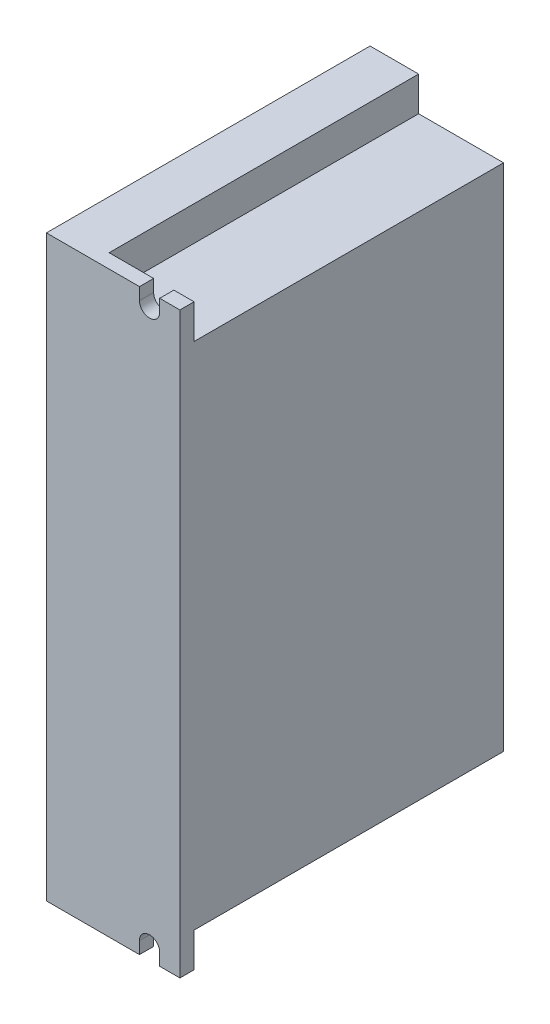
ISO-10303-21;
HEADER;
FILE_DESCRIPTION(('STEP AP214'),'2;1');
FILE_NAME('part.step','',(''),(''),'','','');
FILE_SCHEMA(('AUTOMOTIVE_DESIGN { 1 0 10303 214 1 1 1 1 }'));
ENDSEC;
DATA;
#1=APPLICATION_CONTEXT('core data for automotive mechanical design processes');
#2=APPLICATION_PROTOCOL_DEFINITION('international standard','automotive_design',2000,#1);
#3=PRODUCT_CONTEXT('',#1,'mechanical');
#4=PRODUCT('Part','Part','',(#3));
#5=PRODUCT_RELATED_PRODUCT_CATEGORY('part','',(#4));
#6=PRODUCT_DEFINITION_FORMATION('','',#4);
#7=PRODUCT_DEFINITION_CONTEXT('part definition',#1,'design');
#8=PRODUCT_DEFINITION('design','',#6,#7);
#9=PRODUCT_DEFINITION_SHAPE('','',#8);
#10=(LENGTH_UNIT() NAMED_UNIT(*) SI_UNIT(.MILLI.,.METRE.));
#11=(NAMED_UNIT(*) PLANE_ANGLE_UNIT() SI_UNIT($,.RADIAN.));
#12=(NAMED_UNIT(*) SI_UNIT($,.STERADIAN.) SOLID_ANGLE_UNIT());
#13=UNCERTAINTY_MEASURE_WITH_UNIT(LENGTH_MEASURE(1.E-05),#10,'distance_accuracy_value','');
#14=(GEOMETRIC_REPRESENTATION_CONTEXT(3) GLOBAL_UNCERTAINTY_ASSIGNED_CONTEXT((#13)) GLOBAL_UNIT_ASSIGNED_CONTEXT((#10,
#11,#12)) REPRESENTATION_CONTEXT('',''));
#15=CARTESIAN_POINT('',(0.,0.,0.));
#16=DIRECTION('',(0.,0.,1.));
#17=DIRECTION('',(1.,0.,0.));
#18=AXIS2_PLACEMENT_3D('',#15,#16,#17);
#19=CARTESIAN_POINT('',(33.,71.5,40.));
#20=DIRECTION('',(0.,-1.,0.));
#21=DIRECTION('',(0.,0.,-1.));
#22=AXIS2_PLACEMENT_3D('',#19,#20,#21);
#23=PLANE('',#22);
#24=DIRECTION('',(1.,0.,0.));
#25=VECTOR('',#24,1.);
#26=CARTESIAN_POINT('',(12.,71.5,36.5));
#27=LINE('',#26,#25);
#28=CARTESIAN_POINT('',(28.,71.5,36.5));
#29=VERTEX_POINT('',#28);
#30=CARTESIAN_POINT('',(33.,71.5,36.5));
#31=VERTEX_POINT('',#30);
#32=EDGE_CURVE('E228',#29,#31,#27,.T.);
#33=ORIENTED_EDGE('',*,*,#32,.F.);
#34=DIRECTION('',(0.,0.,-1.));
#35=VECTOR('',#34,1.);
#36=CARTESIAN_POINT('',(28.,71.5,40.));
#37=LINE('',#36,#35);
#38=CARTESIAN_POINT('',(28.,71.5,40.));
#39=VERTEX_POINT('',#38);
#40=EDGE_CURVE('E185',#39,#29,#37,.T.);
#41=ORIENTED_EDGE('',*,*,#40,.F.);
#42=DIRECTION('',(-1.,0.,0.));
#43=VECTOR('',#42,1.);
#44=CARTESIAN_POINT('',(33.,71.5,40.));
#45=LINE('',#44,#43);
#46=CARTESIAN_POINT('',(33.,71.5,40.));
#47=VERTEX_POINT('',#46);
#48=EDGE_CURVE('E41',#47,#39,#45,.T.);
#49=ORIENTED_EDGE('',*,*,#48,.F.);
#50=DIRECTION('',(0.,0.,1.));
#51=VECTOR('',#50,1.);
#52=CARTESIAN_POINT('',(33.,71.5,40.));
#53=LINE('',#52,#51);
#54=EDGE_CURVE('E269',#31,#47,#53,.T.);
#55=ORIENTED_EDGE('',*,*,#54,.F.);
#56=EDGE_LOOP('',(#33,#41,#49,#55));
#57=FACE_BOUND('',#56,.T.);
#58=ADVANCED_FACE('F33',(#57),#23,.F.);
#59=CARTESIAN_POINT('',(33.,-71.5,40.));
#60=DIRECTION('',(0.,1.,0.));
#61=DIRECTION('',(0.,0.,1.));
#62=AXIS2_PLACEMENT_3D('',#59,#60,#61);
#63=PLANE('',#62);
#64=DIRECTION('',(1.,0.,0.));
#65=VECTOR('',#64,1.);
#66=CARTESIAN_POINT('',(12.,-71.5,36.5));
#67=LINE('',#66,#65);
#68=CARTESIAN_POINT('',(12.,-71.5,36.5));
#69=VERTEX_POINT('',#68);
#70=CARTESIAN_POINT('',(23.,-71.5,36.5));
#71=VERTEX_POINT('',#70);
#72=EDGE_CURVE('E258',#69,#71,#67,.T.);
#73=ORIENTED_EDGE('',*,*,#72,.T.);
#74=DIRECTION('',(0.,0.,-1.));
#75=VECTOR('',#74,1.);
#76=CARTESIAN_POINT('',(23.,-71.5,40.));
#77=LINE('',#76,#75);
#78=CARTESIAN_POINT('',(23.,-71.5,40.));
#79=VERTEX_POINT('',#78);
#80=EDGE_CURVE('E210',#79,#71,#77,.T.);
#81=ORIENTED_EDGE('',*,*,#80,.F.);
#82=DIRECTION('',(-1.,0.,0.));
#83=VECTOR('',#82,1.);
#84=CARTESIAN_POINT('',(33.,-71.5,40.));
#85=LINE('',#84,#83);
#86=CARTESIAN_POINT('',(0.,-71.5,40.));
#87=VERTEX_POINT('',#86);
#88=EDGE_CURVE('E289',#79,#87,#85,.T.);
#89=ORIENTED_EDGE('',*,*,#88,.T.);
#90=DIRECTION('',(0.,0.,-1.));
#91=VECTOR('',#90,1.);
#92=CARTESIAN_POINT('',(0.,-71.5,40.));
#93=LINE('',#92,#91);
#94=CARTESIAN_POINT('',(0.,-71.5,-40.));
#95=VERTEX_POINT('',#94);
#96=EDGE_CURVE('E270',#87,#95,#93,.T.);
#97=ORIENTED_EDGE('',*,*,#96,.T.);
#98=DIRECTION('',(-1.,0.,0.));
#99=VECTOR('',#98,1.);
#100=CARTESIAN_POINT('',(33.,-71.5,-40.));
#101=LINE('',#100,#99);
#102=CARTESIAN_POINT('',(12.,-71.5,-40.));
#103=VERTEX_POINT('',#102);
#104=EDGE_CURVE('E277',#103,#95,#101,.T.);
#105=ORIENTED_EDGE('',*,*,#104,.F.);
#106=DIRECTION('',(0.,0.,-1.));
#107=VECTOR('',#106,1.);
#108=CARTESIAN_POINT('',(12.,-71.5,-40.));
#109=LINE('',#108,#107);
#110=EDGE_CURVE('E241',#69,#103,#109,.T.);
#111=ORIENTED_EDGE('',*,*,#110,.F.);
#112=EDGE_LOOP('',(#73,#81,#89,#97,#105,#111));
#113=FACE_BOUND('',#112,.T.);
#114=ADVANCED_FACE('F307',(#113),#63,.F.);
#115=CARTESIAN_POINT('',(33.,-71.5,-40.));
#116=DIRECTION('',(0.,0.,1.));
#117=DIRECTION('',(1.,0.,0.));
#118=AXIS2_PLACEMENT_3D('',#115,#116,#117);
#119=PLANE('',#118);
#120=DIRECTION('',(0.,1.,0.));
#121=VECTOR('',#120,1.);
#122=CARTESIAN_POINT('',(12.,71.5,-40.));
#123=LINE('',#122,#121);
#124=CARTESIAN_POINT('',(12.,63.,-40.));
#125=VERTEX_POINT('',#124);
#126=CARTESIAN_POINT('',(12.,71.5,-40.));
#127=VERTEX_POINT('',#126);
#128=EDGE_CURVE('E226',#125,#127,#123,.T.);
#129=ORIENTED_EDGE('',*,*,#128,.F.);
#130=DIRECTION('',(1.,0.,0.));
#131=VECTOR('',#130,1.);
#132=CARTESIAN_POINT('',(12.,63.,-40.));
#133=LINE('',#132,#131);
#134=CARTESIAN_POINT('',(33.,63.,-40.));
#135=VERTEX_POINT('',#134);
#136=EDGE_CURVE('E232',#125,#135,#133,.T.);
#137=ORIENTED_EDGE('',*,*,#136,.T.);
#138=DIRECTION('',(0.,1.,0.));
#139=VECTOR('',#138,1.);
#140=CARTESIAN_POINT('',(33.,-71.5,-40.));
#141=LINE('',#140,#139);
#142=CARTESIAN_POINT('',(33.,-63.,-40.));
#143=VERTEX_POINT('',#142);
#144=EDGE_CURVE('E266',#143,#135,#141,.T.);
#145=ORIENTED_EDGE('',*,*,#144,.F.);
#146=DIRECTION('',(1.,0.,0.));
#147=VECTOR('',#146,1.);
#148=CARTESIAN_POINT('',(12.,-63.,-40.));
#149=LINE('',#148,#147);
#150=CARTESIAN_POINT('',(12.,-63.,-40.));
#151=VERTEX_POINT('',#150);
#152=EDGE_CURVE('E253',#151,#143,#149,.T.);
#153=ORIENTED_EDGE('',*,*,#152,.F.);
#154=DIRECTION('',(0.,1.,0.));
#155=VECTOR('',#154,1.);
#156=CARTESIAN_POINT('',(12.,-63.,-40.));
#157=LINE('',#156,#155);
#158=EDGE_CURVE('E243',#103,#151,#157,.T.);
#159=ORIENTED_EDGE('',*,*,#158,.F.);
#160=ORIENTED_EDGE('',*,*,#104,.T.);
#161=DIRECTION('',(0.,1.,0.));
#162=VECTOR('',#161,1.);
#163=CARTESIAN_POINT('',(0.,-71.5,-40.));
#164=LINE('',#163,#162);
#165=CARTESIAN_POINT('',(0.,71.5,-40.));
#166=VERTEX_POINT('',#165);
#167=EDGE_CURVE('E261',#95,#166,#164,.T.);
#168=ORIENTED_EDGE('',*,*,#167,.T.);
#169=DIRECTION('',(-1.,0.,0.));
#170=VECTOR('',#169,1.);
#171=CARTESIAN_POINT('',(33.,71.5,-40.));
#172=LINE('',#171,#170);
#173=EDGE_CURVE('E11',#127,#166,#172,.T.);
#174=ORIENTED_EDGE('',*,*,#173,.F.);
#175=EDGE_LOOP('',(#129,#137,#145,#153,#159,#160,#168,#174));
#176=FACE_BOUND('',#175,.T.);
#177=ADVANCED_FACE('F35',(#176),#119,.F.);
#178=CARTESIAN_POINT('',(23.,71.5,40.));
#179=VERTEX_POINT('',#178);
#180=CARTESIAN_POINT('',(0.,71.5,40.));
#181=VERTEX_POINT('',#180);
#182=EDGE_CURVE('E292',#179,#181,#45,.T.);
#183=ORIENTED_EDGE('',*,*,#182,.F.);
#184=DIRECTION('',(0.,0.,-1.));
#185=VECTOR('',#184,1.);
#186=CARTESIAN_POINT('',(23.,71.5,40.));
#187=LINE('',#186,#185);
#188=CARTESIAN_POINT('',(23.,71.5,36.5));
#189=VERTEX_POINT('',#188);
#190=EDGE_CURVE('E187',#179,#189,#187,.T.);
#191=ORIENTED_EDGE('',*,*,#190,.T.);
#192=CARTESIAN_POINT('',(12.,71.5,36.5));
#193=VERTEX_POINT('',#192);
#194=EDGE_CURVE('E238',#193,#189,#27,.T.);
#195=ORIENTED_EDGE('',*,*,#194,.F.);
#196=DIRECTION('',(0.,0.,1.));
#197=VECTOR('',#196,1.);
#198=CARTESIAN_POINT('',(12.,71.5,36.5));
#199=LINE('',#198,#197);
#200=EDGE_CURVE('E216',#127,#193,#199,.T.);
#201=ORIENTED_EDGE('',*,*,#200,.F.);
#202=ORIENTED_EDGE('',*,*,#173,.T.);
#203=DIRECTION('',(0.,0.,1.));
#204=VECTOR('',#203,1.);
#205=CARTESIAN_POINT('',(0.,71.5,40.));
#206=LINE('',#205,#204);
#207=EDGE_CURVE('E280',#166,#181,#206,.T.);
#208=ORIENTED_EDGE('',*,*,#207,.T.);
#209=EDGE_LOOP('',(#183,#191,#195,#201,#202,#208));
#210=FACE_BOUND('',#209,.T.);
#211=ADVANCED_FACE('F299',(#210),#23,.F.);
#212=CARTESIAN_POINT('',(33.,-71.5,40.));
#213=DIRECTION('',(0.,0.,-1.));
#214=DIRECTION('',(-1.,0.,0.));
#215=AXIS2_PLACEMENT_3D('',#212,#213,#214);
#216=PLANE('',#215);
#217=ORIENTED_EDGE('',*,*,#48,.T.);
#218=DIRECTION('',(0.,-1.,0.));
#219=VECTOR('',#218,1.);
#220=CARTESIAN_POINT('',(28.,71.5,40.));
#221=LINE('',#220,#219);
#222=CARTESIAN_POINT('',(28.,68.5,40.));
#223=VERTEX_POINT('',#222);
#224=EDGE_CURVE('E158',#39,#223,#221,.T.);
#225=ORIENTED_EDGE('',*,*,#224,.T.);
#226=CARTESIAN_POINT('',(25.5,68.5,40.));
#227=DIRECTION('',(0.,0.,-1.));
#228=DIRECTION('',(-1.,0.,0.));
#229=AXIS2_PLACEMENT_3D('',#226,#227,#228);
#230=CIRCLE('',#229,2.5);
#231=CARTESIAN_POINT('',(23.,68.5,40.));
#232=VERTEX_POINT('',#231);
#233=EDGE_CURVE('E167',#223,#232,#230,.T.);
#234=ORIENTED_EDGE('',*,*,#233,.T.);
#235=DIRECTION('',(0.,1.,0.));
#236=VECTOR('',#235,1.);
#237=CARTESIAN_POINT('',(23.,68.5,40.));
#238=LINE('',#237,#236);
#239=EDGE_CURVE('E164',#232,#179,#238,.T.);
#240=ORIENTED_EDGE('',*,*,#239,.T.);
#241=ORIENTED_EDGE('',*,*,#182,.T.);
#242=DIRECTION('',(0.,-1.,0.));
#243=VECTOR('',#242,1.);
#244=CARTESIAN_POINT('',(0.,-71.5,40.));
#245=LINE('',#244,#243);
#246=EDGE_CURVE('E283',#181,#87,#245,.T.);
#247=ORIENTED_EDGE('',*,*,#246,.T.);
#248=ORIENTED_EDGE('',*,*,#88,.F.);
#249=DIRECTION('',(0.,1.,0.));
#250=VECTOR('',#249,1.);
#251=CARTESIAN_POINT('',(23.,-68.5,40.));
#252=LINE('',#251,#250);
#253=CARTESIAN_POINT('',(23.,-68.5,40.));
#254=VERTEX_POINT('',#253);
#255=EDGE_CURVE('E198',#79,#254,#252,.T.);
#256=ORIENTED_EDGE('',*,*,#255,.T.);
#257=CARTESIAN_POINT('',(25.5,-68.5,40.));
#258=DIRECTION('',(0.,0.,-1.));
#259=DIRECTION('',(-1.,0.,0.));
#260=AXIS2_PLACEMENT_3D('',#257,#258,#259);
#261=CIRCLE('',#260,2.5);
#262=CARTESIAN_POINT('',(28.,-68.5,40.));
#263=VERTEX_POINT('',#262);
#264=EDGE_CURVE('E191',#254,#263,#261,.T.);
#265=ORIENTED_EDGE('',*,*,#264,.T.);
#266=DIRECTION('',(0.,-1.,0.));
#267=VECTOR('',#266,1.);
#268=CARTESIAN_POINT('',(28.,-71.5,40.));
#269=LINE('',#268,#267);
#270=CARTESIAN_POINT('',(28.,-71.5,40.));
#271=VERTEX_POINT('',#270);
#272=EDGE_CURVE('E194',#263,#271,#269,.T.);
#273=ORIENTED_EDGE('',*,*,#272,.T.);
#274=CARTESIAN_POINT('',(33.,-71.5,40.));
#275=VERTEX_POINT('',#274);
#276=EDGE_CURVE('E290',#275,#271,#85,.T.);
#277=ORIENTED_EDGE('',*,*,#276,.F.);
#278=DIRECTION('',(0.,-1.,0.));
#279=VECTOR('',#278,1.);
#280=CARTESIAN_POINT('',(33.,-71.5,40.));
#281=LINE('',#280,#279);
#282=EDGE_CURVE('E272',#47,#275,#281,.T.);
#283=ORIENTED_EDGE('',*,*,#282,.F.);
#284=EDGE_LOOP('',(#217,#225,#234,#240,#241,#247,#248,#256,#265,#273,#277,#283));
#285=FACE_BOUND('',#284,.T.);
#286=ADVANCED_FACE('F174',(#285),#216,.F.);
#287=ORIENTED_EDGE('',*,*,#276,.T.);
#288=DIRECTION('',(0.,0.,-1.));
#289=VECTOR('',#288,1.);
#290=CARTESIAN_POINT('',(28.,-71.5,40.));
#291=LINE('',#290,#289);
#292=CARTESIAN_POINT('',(28.,-71.5,36.5));
#293=VERTEX_POINT('',#292);
#294=EDGE_CURVE('E212',#271,#293,#291,.T.);
#295=ORIENTED_EDGE('',*,*,#294,.T.);
#296=CARTESIAN_POINT('',(33.,-71.5,36.5));
#297=VERTEX_POINT('',#296);
#298=EDGE_CURVE('E262',#293,#297,#67,.T.);
#299=ORIENTED_EDGE('',*,*,#298,.T.);
#300=DIRECTION('',(0.,0.,-1.));
#301=VECTOR('',#300,1.);
#302=CARTESIAN_POINT('',(33.,-71.5,40.));
#303=LINE('',#302,#301);
#304=EDGE_CURVE('E274',#275,#297,#303,.T.);
#305=ORIENTED_EDGE('',*,*,#304,.F.);
#306=EDGE_LOOP('',(#287,#295,#299,#305));
#307=FACE_BOUND('',#306,.T.);
#308=ADVANCED_FACE('F322',(#307),#63,.F.);
#309=CARTESIAN_POINT('',(33.,0.,0.));
#310=DIRECTION('',(-1.,0.,0.));
#311=DIRECTION('',(0.,0.,1.));
#312=AXIS2_PLACEMENT_3D('',#309,#310,#311);
#313=PLANE('',#312);
#314=ORIENTED_EDGE('',*,*,#144,.T.);
#315=DIRECTION('',(0.,0.,-1.));
#316=VECTOR('',#315,1.);
#317=CARTESIAN_POINT('',(33.,63.,-40.));
#318=LINE('',#317,#316);
#319=CARTESIAN_POINT('',(33.,63.,36.5));
#320=VERTEX_POINT('',#319);
#321=EDGE_CURVE('E220',#320,#135,#318,.T.);
#322=ORIENTED_EDGE('',*,*,#321,.F.);
#323=DIRECTION('',(0.,-1.,0.));
#324=VECTOR('',#323,1.);
#325=CARTESIAN_POINT('',(33.,63.,36.5));
#326=LINE('',#325,#324);
#327=EDGE_CURVE('E209',#31,#320,#326,.T.);
#328=ORIENTED_EDGE('',*,*,#327,.F.);
#329=ORIENTED_EDGE('',*,*,#54,.T.);
#330=ORIENTED_EDGE('',*,*,#282,.T.);
#331=ORIENTED_EDGE('',*,*,#304,.T.);
#332=DIRECTION('',(0.,-1.,0.));
#333=VECTOR('',#332,1.);
#334=CARTESIAN_POINT('',(33.,-71.5,36.5));
#335=LINE('',#334,#333);
#336=CARTESIAN_POINT('',(33.,-63.,36.5));
#337=VERTEX_POINT('',#336);
#338=EDGE_CURVE('E244',#337,#297,#335,.T.);
#339=ORIENTED_EDGE('',*,*,#338,.F.);
#340=DIRECTION('',(0.,0.,1.));
#341=VECTOR('',#340,1.);
#342=CARTESIAN_POINT('',(33.,-63.,36.5));
#343=LINE('',#342,#341);
#344=EDGE_CURVE('E235',#143,#337,#343,.T.);
#345=ORIENTED_EDGE('',*,*,#344,.F.);
#346=EDGE_LOOP('',(#314,#322,#328,#329,#330,#331,#339,#345));
#347=FACE_BOUND('',#346,.T.);
#348=ADVANCED_FACE('F326',(#347),#313,.F.);
#349=CARTESIAN_POINT('',(0.,0.,0.));
#350=DIRECTION('',(-1.,0.,0.));
#351=DIRECTION('',(0.,0.,1.));
#352=AXIS2_PLACEMENT_3D('',#349,#350,#351);
#353=PLANE('',#352);
#354=ORIENTED_EDGE('',*,*,#167,.F.);
#355=ORIENTED_EDGE('',*,*,#96,.F.);
#356=ORIENTED_EDGE('',*,*,#246,.F.);
#357=ORIENTED_EDGE('',*,*,#207,.F.);
#358=EDGE_LOOP('',(#354,#355,#356,#357));
#359=FACE_BOUND('',#358,.T.);
#360=ADVANCED_FACE('F304',(#359),#353,.T.);
#361=CARTESIAN_POINT('',(12.,-71.5,36.5));
#362=DIRECTION('',(0.,0.,1.));
#363=DIRECTION('',(1.,0.,0.));
#364=AXIS2_PLACEMENT_3D('',#361,#362,#363);
#365=PLANE('',#364);
#366=CARTESIAN_POINT('',(25.5,-68.5,36.5));
#367=DIRECTION('',(0.,0.,-1.));
#368=DIRECTION('',(-1.,0.,0.));
#369=AXIS2_PLACEMENT_3D('',#366,#367,#368);
#370=CIRCLE('',#369,2.5);
#371=CARTESIAN_POINT('',(23.,-68.5,36.5));
#372=VERTEX_POINT('',#371);
#373=CARTESIAN_POINT('',(28.,-68.5,36.5));
#374=VERTEX_POINT('',#373);
#375=EDGE_CURVE('E56',#372,#374,#370,.T.);
#376=ORIENTED_EDGE('',*,*,#375,.F.);
#377=DIRECTION('',(0.,1.,0.));
#378=VECTOR('',#377,1.);
#379=CARTESIAN_POINT('',(23.,-68.5,36.5));
#380=LINE('',#379,#378);
#381=EDGE_CURVE('E195',#71,#372,#380,.T.);
#382=ORIENTED_EDGE('',*,*,#381,.F.);
#383=ORIENTED_EDGE('',*,*,#72,.F.);
#384=DIRECTION('',(0.,-1.,0.));
#385=VECTOR('',#384,1.);
#386=CARTESIAN_POINT('',(12.,-71.5,36.5));
#387=LINE('',#386,#385);
#388=CARTESIAN_POINT('',(12.,-63.,36.5));
#389=VERTEX_POINT('',#388);
#390=EDGE_CURVE('E250',#389,#69,#387,.T.);
#391=ORIENTED_EDGE('',*,*,#390,.F.);
#392=DIRECTION('',(1.,0.,0.));
#393=VECTOR('',#392,1.);
#394=CARTESIAN_POINT('',(12.,-63.,36.5));
#395=LINE('',#394,#393);
#396=EDGE_CURVE('E263',#389,#337,#395,.T.);
#397=ORIENTED_EDGE('',*,*,#396,.T.);
#398=ORIENTED_EDGE('',*,*,#338,.T.);
#399=ORIENTED_EDGE('',*,*,#298,.F.);
#400=DIRECTION('',(0.,-1.,0.));
#401=VECTOR('',#400,1.);
#402=CARTESIAN_POINT('',(28.,-71.5,36.5));
#403=LINE('',#402,#401);
#404=EDGE_CURVE('E203',#374,#293,#403,.T.);
#405=ORIENTED_EDGE('',*,*,#404,.F.);
#406=EDGE_LOOP('',(#376,#382,#383,#391,#397,#398,#399,#405));
#407=FACE_BOUND('',#406,.T.);
#408=ADVANCED_FACE('F349',(#407),#365,.F.);
#409=CARTESIAN_POINT('',(12.,-63.,36.5));
#410=DIRECTION('',(0.,1.,0.));
#411=DIRECTION('',(0.,0.,1.));
#412=AXIS2_PLACEMENT_3D('',#409,#410,#411);
#413=PLANE('',#412);
#414=ORIENTED_EDGE('',*,*,#344,.T.);
#415=ORIENTED_EDGE('',*,*,#396,.F.);
#416=DIRECTION('',(0.,0.,1.));
#417=VECTOR('',#416,1.);
#418=CARTESIAN_POINT('',(12.,-63.,36.5));
#419=LINE('',#418,#417);
#420=EDGE_CURVE('E247',#151,#389,#419,.T.);
#421=ORIENTED_EDGE('',*,*,#420,.F.);
#422=ORIENTED_EDGE('',*,*,#152,.T.);
#423=EDGE_LOOP('',(#414,#415,#421,#422));
#424=FACE_BOUND('',#423,.T.);
#425=ADVANCED_FACE('F351',(#424),#413,.F.);
#426=CARTESIAN_POINT('',(12.,0.,0.));
#427=DIRECTION('',(-1.,0.,0.));
#428=DIRECTION('',(0.,0.,1.));
#429=AXIS2_PLACEMENT_3D('',#426,#427,#428);
#430=PLANE('',#429);
#431=ORIENTED_EDGE('',*,*,#110,.T.);
#432=ORIENTED_EDGE('',*,*,#158,.T.);
#433=ORIENTED_EDGE('',*,*,#420,.T.);
#434=ORIENTED_EDGE('',*,*,#390,.T.);
#435=EDGE_LOOP('',(#431,#432,#433,#434));
#436=FACE_BOUND('',#435,.T.);
#437=ADVANCED_FACE('F346',(#436),#430,.F.);
#438=CARTESIAN_POINT('',(12.,63.,-40.));
#439=DIRECTION('',(0.,-1.,0.));
#440=DIRECTION('',(0.,0.,-1.));
#441=AXIS2_PLACEMENT_3D('',#438,#439,#440);
#442=PLANE('',#441);
#443=ORIENTED_EDGE('',*,*,#321,.T.);
#444=ORIENTED_EDGE('',*,*,#136,.F.);
#445=DIRECTION('',(0.,0.,-1.));
#446=VECTOR('',#445,1.);
#447=CARTESIAN_POINT('',(12.,63.,-40.));
#448=LINE('',#447,#446);
#449=CARTESIAN_POINT('',(12.,63.,36.5));
#450=VERTEX_POINT('',#449);
#451=EDGE_CURVE('E223',#450,#125,#448,.T.);
#452=ORIENTED_EDGE('',*,*,#451,.F.);
#453=DIRECTION('',(1.,0.,0.));
#454=VECTOR('',#453,1.);
#455=CARTESIAN_POINT('',(12.,63.,36.5));
#456=LINE('',#455,#454);
#457=EDGE_CURVE('E236',#450,#320,#456,.T.);
#458=ORIENTED_EDGE('',*,*,#457,.T.);
#459=EDGE_LOOP('',(#443,#444,#452,#458));
#460=FACE_BOUND('',#459,.T.);
#461=ADVANCED_FACE('F354',(#460),#442,.F.);
#462=CARTESIAN_POINT('',(12.,63.,36.5));
#463=DIRECTION('',(0.,0.,1.));
#464=DIRECTION('',(1.,0.,0.));
#465=AXIS2_PLACEMENT_3D('',#462,#463,#464);
#466=PLANE('',#465);
#467=CARTESIAN_POINT('',(25.5,68.5,36.5));
#468=DIRECTION('',(0.,0.,-1.));
#469=DIRECTION('',(-1.,0.,0.));
#470=AXIS2_PLACEMENT_3D('',#467,#468,#469);
#471=CIRCLE('',#470,2.5);
#472=CARTESIAN_POINT('',(28.,68.5,36.5));
#473=VERTEX_POINT('',#472);
#474=CARTESIAN_POINT('',(23.,68.5,36.5));
#475=VERTEX_POINT('',#474);
#476=EDGE_CURVE('E179',#473,#475,#471,.T.);
#477=ORIENTED_EDGE('',*,*,#476,.F.);
#478=DIRECTION('',(0.,-1.,0.));
#479=VECTOR('',#478,1.);
#480=CARTESIAN_POINT('',(28.,71.5,36.5));
#481=LINE('',#480,#479);
#482=EDGE_CURVE('E48',#29,#473,#481,.T.);
#483=ORIENTED_EDGE('',*,*,#482,.F.);
#484=ORIENTED_EDGE('',*,*,#32,.T.);
#485=ORIENTED_EDGE('',*,*,#327,.T.);
#486=ORIENTED_EDGE('',*,*,#457,.F.);
#487=DIRECTION('',(0.,-1.,0.));
#488=VECTOR('',#487,1.);
#489=CARTESIAN_POINT('',(12.,63.,36.5));
#490=LINE('',#489,#488);
#491=EDGE_CURVE('E219',#193,#450,#490,.T.);
#492=ORIENTED_EDGE('',*,*,#491,.F.);
#493=ORIENTED_EDGE('',*,*,#194,.T.);
#494=DIRECTION('',(0.,1.,0.));
#495=VECTOR('',#494,1.);
#496=CARTESIAN_POINT('',(23.,68.5,36.5));
#497=LINE('',#496,#495);
#498=EDGE_CURVE('E177',#475,#189,#497,.T.);
#499=ORIENTED_EDGE('',*,*,#498,.F.);
#500=EDGE_LOOP('',(#477,#483,#484,#485,#486,#492,#493,#499));
#501=FACE_BOUND('',#500,.T.);
#502=ADVANCED_FACE('F334',(#501),#466,.F.);
#503=CARTESIAN_POINT('',(12.,0.,0.));
#504=DIRECTION('',(-1.,0.,0.));
#505=DIRECTION('',(0.,0.,1.));
#506=AXIS2_PLACEMENT_3D('',#503,#504,#505);
#507=PLANE('',#506);
#508=ORIENTED_EDGE('',*,*,#200,.T.);
#509=ORIENTED_EDGE('',*,*,#491,.T.);
#510=ORIENTED_EDGE('',*,*,#451,.T.);
#511=ORIENTED_EDGE('',*,*,#128,.T.);
#512=EDGE_LOOP('',(#508,#509,#510,#511));
#513=FACE_BOUND('',#512,.T.);
#514=ADVANCED_FACE('F355',(#513),#507,.F.);
#515=CARTESIAN_POINT('',(25.5,-68.5,40.));
#516=DIRECTION('',(0.,0.,-1.));
#517=DIRECTION('',(-1.,0.,0.));
#518=AXIS2_PLACEMENT_3D('',#515,#516,#517);
#519=CYLINDRICAL_SURFACE('',#518,2.5);
#520=ORIENTED_EDGE('',*,*,#375,.T.);
#521=DIRECTION('',(0.,0.,-1.));
#522=VECTOR('',#521,1.);
#523=CARTESIAN_POINT('',(28.,-68.5,40.));
#524=LINE('',#523,#522);
#525=EDGE_CURVE('E201',#263,#374,#524,.T.);
#526=ORIENTED_EDGE('',*,*,#525,.F.);
#527=ORIENTED_EDGE('',*,*,#264,.F.);
#528=DIRECTION('',(0.,0.,-1.));
#529=VECTOR('',#528,1.);
#530=CARTESIAN_POINT('',(23.,-68.5,40.));
#531=LINE('',#530,#529);
#532=EDGE_CURVE('E207',#254,#372,#531,.T.);
#533=ORIENTED_EDGE('',*,*,#532,.T.);
#534=EDGE_LOOP('',(#520,#526,#527,#533));
#535=FACE_BOUND('',#534,.T.);
#536=ADVANCED_FACE('F314',(#535),#519,.F.);
#537=CARTESIAN_POINT('',(23.,-68.5,40.));
#538=DIRECTION('',(-1.,0.,0.));
#539=DIRECTION('',(0.,0.,1.));
#540=AXIS2_PLACEMENT_3D('',#537,#538,#539);
#541=PLANE('',#540);
#542=ORIENTED_EDGE('',*,*,#381,.T.);
#543=ORIENTED_EDGE('',*,*,#532,.F.);
#544=ORIENTED_EDGE('',*,*,#255,.F.);
#545=ORIENTED_EDGE('',*,*,#80,.T.);
#546=EDGE_LOOP('',(#542,#543,#544,#545));
#547=FACE_BOUND('',#546,.T.);
#548=ADVANCED_FACE('F312',(#547),#541,.F.);
#549=CARTESIAN_POINT('',(28.,-71.5,40.));
#550=DIRECTION('',(1.,0.,0.));
#551=DIRECTION('',(0.,0.,-1.));
#552=AXIS2_PLACEMENT_3D('',#549,#550,#551);
#553=PLANE('',#552);
#554=ORIENTED_EDGE('',*,*,#404,.T.);
#555=ORIENTED_EDGE('',*,*,#294,.F.);
#556=ORIENTED_EDGE('',*,*,#272,.F.);
#557=ORIENTED_EDGE('',*,*,#525,.T.);
#558=EDGE_LOOP('',(#554,#555,#556,#557));
#559=FACE_BOUND('',#558,.T.);
#560=ADVANCED_FACE('F318',(#559),#553,.F.);
#561=CARTESIAN_POINT('',(28.,71.5,40.));
#562=DIRECTION('',(1.,0.,0.));
#563=DIRECTION('',(0.,0.,-1.));
#564=AXIS2_PLACEMENT_3D('',#561,#562,#563);
#565=PLANE('',#564);
#566=ORIENTED_EDGE('',*,*,#482,.T.);
#567=DIRECTION('',(0.,0.,-1.));
#568=VECTOR('',#567,1.);
#569=CARTESIAN_POINT('',(28.,68.5,40.));
#570=LINE('',#569,#568);
#571=EDGE_CURVE('E154',#223,#473,#570,.T.);
#572=ORIENTED_EDGE('',*,*,#571,.F.);
#573=ORIENTED_EDGE('',*,*,#224,.F.);
#574=ORIENTED_EDGE('',*,*,#40,.T.);
#575=EDGE_LOOP('',(#566,#572,#573,#574));
#576=FACE_BOUND('',#575,.T.);
#577=ADVANCED_FACE('F156',(#576),#565,.F.);
#578=CARTESIAN_POINT('',(23.,68.5,40.));
#579=DIRECTION('',(-1.,0.,0.));
#580=DIRECTION('',(0.,-1.,0.));
#581=AXIS2_PLACEMENT_3D('',#578,#579,#580);
#582=PLANE('',#581);
#583=ORIENTED_EDGE('',*,*,#498,.T.);
#584=ORIENTED_EDGE('',*,*,#190,.F.);
#585=ORIENTED_EDGE('',*,*,#239,.F.);
#586=DIRECTION('',(0.,0.,-1.));
#587=VECTOR('',#586,1.);
#588=CARTESIAN_POINT('',(23.,68.5,40.));
#589=LINE('',#588,#587);
#590=EDGE_CURVE('E163',#232,#475,#589,.T.);
#591=ORIENTED_EDGE('',*,*,#590,.T.);
#592=EDGE_LOOP('',(#583,#584,#585,#591));
#593=FACE_BOUND('',#592,.T.);
#594=ADVANCED_FACE('F338',(#593),#582,.F.);
#595=CARTESIAN_POINT('',(25.5,68.5,40.));
#596=DIRECTION('',(0.,0.,-1.));
#597=DIRECTION('',(-1.,0.,0.));
#598=AXIS2_PLACEMENT_3D('',#595,#596,#597);
#599=CYLINDRICAL_SURFACE('',#598,2.5);
#600=ORIENTED_EDGE('',*,*,#476,.T.);
#601=ORIENTED_EDGE('',*,*,#590,.F.);
#602=ORIENTED_EDGE('',*,*,#233,.F.);
#603=ORIENTED_EDGE('',*,*,#571,.T.);
#604=EDGE_LOOP('',(#600,#601,#602,#603));
#605=FACE_BOUND('',#604,.T.);
#606=ADVANCED_FACE('F168',(#605),#599,.F.);
#607=CLOSED_SHELL('',(#58,#114,#177,#211,#286,#308,#348,#360,#408,#425,#437,#461,#502,#514,#536,
#548,#560,#577,#594,#606));
#608=MANIFOLD_SOLID_BREP('B2',#607);
#609=ADVANCED_BREP_SHAPE_REPRESENTATION('',(#18,#608),#14);
#610=SHAPE_DEFINITION_REPRESENTATION(#9,#609);
ENDSEC;
END-ISO-10303-21;
